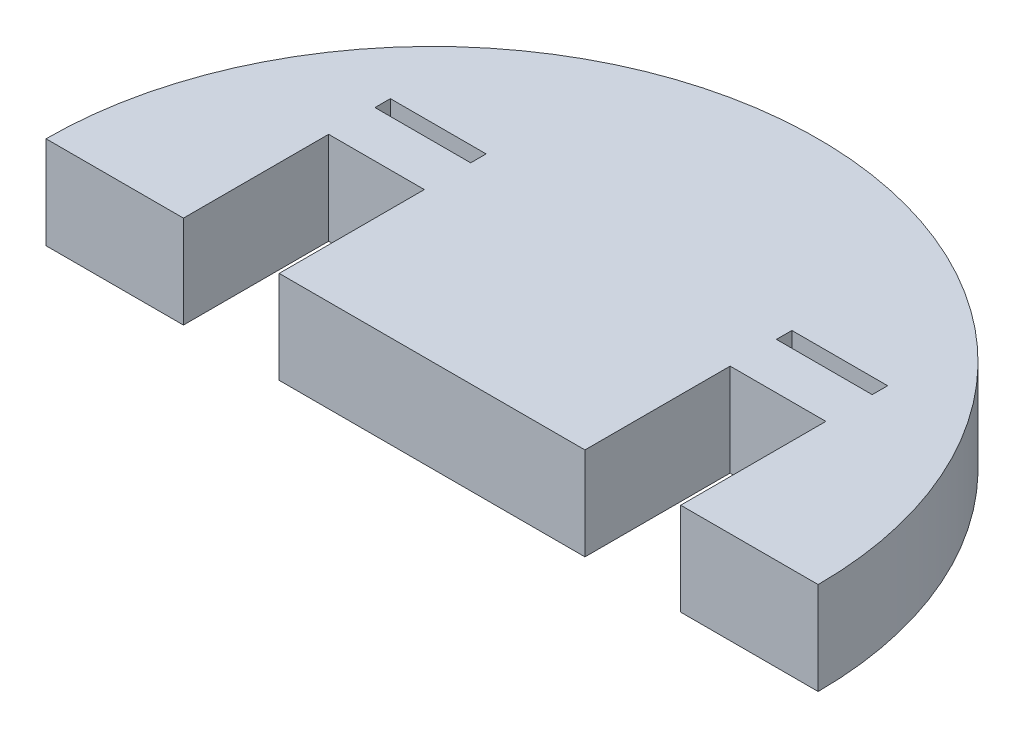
ISO-10303-21;
HEADER;
FILE_DESCRIPTION(('STEP AP214'),'2;1');
FILE_NAME('part.step','',(''),(''),'','','');
FILE_SCHEMA(('AUTOMOTIVE_DESIGN { 1 0 10303 214 1 1 1 1 }'));
ENDSEC;
DATA;
#1=APPLICATION_CONTEXT('core data for automotive mechanical design processes');
#2=APPLICATION_PROTOCOL_DEFINITION('international standard','automotive_design',2000,#1);
#3=PRODUCT_CONTEXT('',#1,'mechanical');
#4=PRODUCT('Part','Part','',(#3));
#5=PRODUCT_RELATED_PRODUCT_CATEGORY('part','',(#4));
#6=PRODUCT_DEFINITION_FORMATION('','',#4);
#7=PRODUCT_DEFINITION_CONTEXT('part definition',#1,'design');
#8=PRODUCT_DEFINITION('design','',#6,#7);
#9=PRODUCT_DEFINITION_SHAPE('','',#8);
#10=(LENGTH_UNIT() NAMED_UNIT(*) SI_UNIT(.MILLI.,.METRE.));
#11=(NAMED_UNIT(*) PLANE_ANGLE_UNIT() SI_UNIT($,.RADIAN.));
#12=(NAMED_UNIT(*) SI_UNIT($,.STERADIAN.) SOLID_ANGLE_UNIT());
#13=UNCERTAINTY_MEASURE_WITH_UNIT(LENGTH_MEASURE(1.E-05),#10,'distance_accuracy_value','');
#14=(GEOMETRIC_REPRESENTATION_CONTEXT(3) GLOBAL_UNCERTAINTY_ASSIGNED_CONTEXT((#13)) GLOBAL_UNIT_ASSIGNED_CONTEXT((#10,
#11,#12)) REPRESENTATION_CONTEXT('',''));
#15=CARTESIAN_POINT('',(0.,0.,0.));
#16=DIRECTION('',(0.,0.,1.));
#17=DIRECTION('',(1.,0.,0.));
#18=AXIS2_PLACEMENT_3D('',#15,#16,#17);
#19=CARTESIAN_POINT('',(16.1,-3.,-13.4));
#20=DIRECTION('',(-1.,0.,0.));
#21=DIRECTION('',(0.,0.,1.));
#22=AXIS2_PLACEMENT_3D('',#19,#20,#21);
#23=PLANE('',#22);
#24=DIRECTION('',(0.,1.,0.));
#25=VECTOR('',#24,1.);
#26=CARTESIAN_POINT('',(16.1,-3.,-13.4));
#27=LINE('',#26,#25);
#28=CARTESIAN_POINT('',(16.1,-3.,-13.4));
#29=VERTEX_POINT('',#28);
#30=CARTESIAN_POINT('',(16.1,3.,-13.4));
#31=VERTEX_POINT('',#30);
#32=EDGE_CURVE('E314',#29,#31,#27,.T.);
#33=ORIENTED_EDGE('',*,*,#32,.F.);
#34=DIRECTION('',(0.,0.,1.));
#35=VECTOR('',#34,1.);
#36=CARTESIAN_POINT('',(16.1,-3.,0.));
#37=LINE('',#36,#35);
#38=CARTESIAN_POINT('',(16.1,-3.,-12.4));
#39=VERTEX_POINT('',#38);
#40=EDGE_CURVE('E244',#29,#39,#37,.T.);
#41=ORIENTED_EDGE('',*,*,#40,.T.);
#42=DIRECTION('',(0.,1.,0.));
#43=VECTOR('',#42,1.);
#44=CARTESIAN_POINT('',(16.1,-3.,-12.4));
#45=LINE('',#44,#43);
#46=CARTESIAN_POINT('',(16.1,3.,-12.4));
#47=VERTEX_POINT('',#46);
#48=EDGE_CURVE('E320',#47,#39,#45,.F.);
#49=ORIENTED_EDGE('',*,*,#48,.F.);
#50=DIRECTION('',(0.,0.,1.));
#51=VECTOR('',#50,1.);
#52=CARTESIAN_POINT('',(16.1,3.,-13.4));
#53=LINE('',#52,#51);
#54=EDGE_CURVE('E251',#47,#31,#53,.F.);
#55=ORIENTED_EDGE('',*,*,#54,.T.);
#56=EDGE_LOOP('',(#33,#41,#49,#55));
#57=FACE_BOUND('',#56,.T.);
#58=ADVANCED_FACE('F17',(#57),#23,.T.);
#59=CARTESIAN_POINT('',(9.9,-3.,-12.4));
#60=DIRECTION('',(1.,0.,0.));
#61=DIRECTION('',(0.,0.,-1.));
#62=AXIS2_PLACEMENT_3D('',#59,#60,#61);
#63=PLANE('',#62);
#64=DIRECTION('',(0.,1.,0.));
#65=VECTOR('',#64,1.);
#66=CARTESIAN_POINT('',(9.9,-3.,-12.4));
#67=LINE('',#66,#65);
#68=CARTESIAN_POINT('',(9.9,-3.,-12.4));
#69=VERTEX_POINT('',#68);
#70=CARTESIAN_POINT('',(9.9,3.,-12.4));
#71=VERTEX_POINT('',#70);
#72=EDGE_CURVE('E254',#69,#71,#67,.T.);
#73=ORIENTED_EDGE('',*,*,#72,.F.);
#74=DIRECTION('',(0.,0.,1.));
#75=VECTOR('',#74,1.);
#76=CARTESIAN_POINT('',(9.9,-3.,0.));
#77=LINE('',#76,#75);
#78=CARTESIAN_POINT('',(9.9,-3.,-13.4));
#79=VERTEX_POINT('',#78);
#80=EDGE_CURVE('E242',#69,#79,#77,.F.);
#81=ORIENTED_EDGE('',*,*,#80,.T.);
#82=DIRECTION('',(0.,1.,0.));
#83=VECTOR('',#82,1.);
#84=CARTESIAN_POINT('',(9.9,-3.,-13.4));
#85=LINE('',#84,#83);
#86=CARTESIAN_POINT('',(9.9,3.,-13.4));
#87=VERTEX_POINT('',#86);
#88=EDGE_CURVE('E311',#87,#79,#85,.F.);
#89=ORIENTED_EDGE('',*,*,#88,.F.);
#90=DIRECTION('',(0.,0.,-1.));
#91=VECTOR('',#90,1.);
#92=CARTESIAN_POINT('',(9.9,3.,-12.4));
#93=LINE('',#92,#91);
#94=EDGE_CURVE('E249',#87,#71,#93,.F.);
#95=ORIENTED_EDGE('',*,*,#94,.T.);
#96=EDGE_LOOP('',(#73,#81,#89,#95));
#97=FACE_BOUND('',#96,.T.);
#98=ADVANCED_FACE('F375',(#97),#63,.T.);
#99=CARTESIAN_POINT('',(-9.9,-3.,-13.4));
#100=DIRECTION('',(-1.,0.,0.));
#101=DIRECTION('',(0.,0.,1.));
#102=AXIS2_PLACEMENT_3D('',#99,#100,#101);
#103=PLANE('',#102);
#104=DIRECTION('',(0.,1.,0.));
#105=VECTOR('',#104,1.);
#106=CARTESIAN_POINT('',(-9.9,-3.,-13.4));
#107=LINE('',#106,#105);
#108=CARTESIAN_POINT('',(-9.9,-3.,-13.4));
#109=VERTEX_POINT('',#108);
#110=CARTESIAN_POINT('',(-9.9,3.,-13.4));
#111=VERTEX_POINT('',#110);
#112=EDGE_CURVE('E297',#109,#111,#107,.T.);
#113=ORIENTED_EDGE('',*,*,#112,.F.);
#114=DIRECTION('',(0.,0.,1.));
#115=VECTOR('',#114,1.);
#116=CARTESIAN_POINT('',(-9.9,-3.,0.));
#117=LINE('',#116,#115);
#118=CARTESIAN_POINT('',(-9.9,-3.,-12.4));
#119=VERTEX_POINT('',#118);
#120=EDGE_CURVE('E240',#109,#119,#117,.T.);
#121=ORIENTED_EDGE('',*,*,#120,.T.);
#122=DIRECTION('',(0.,1.,0.));
#123=VECTOR('',#122,1.);
#124=CARTESIAN_POINT('',(-9.9,-3.,-12.4));
#125=LINE('',#124,#123);
#126=CARTESIAN_POINT('',(-9.9,3.,-12.4));
#127=VERTEX_POINT('',#126);
#128=EDGE_CURVE('E302',#127,#119,#125,.F.);
#129=ORIENTED_EDGE('',*,*,#128,.F.);
#130=DIRECTION('',(0.,0.,1.));
#131=VECTOR('',#130,1.);
#132=CARTESIAN_POINT('',(-9.9,3.,-13.4));
#133=LINE('',#132,#131);
#134=EDGE_CURVE('E35',#127,#111,#133,.F.);
#135=ORIENTED_EDGE('',*,*,#134,.T.);
#136=EDGE_LOOP('',(#113,#121,#129,#135));
#137=FACE_BOUND('',#136,.T.);
#138=ADVANCED_FACE('F398',(#137),#103,.T.);
#139=CARTESIAN_POINT('',(-16.1,-3.,-12.4));
#140=DIRECTION('',(1.,0.,0.));
#141=DIRECTION('',(0.,0.,-1.));
#142=AXIS2_PLACEMENT_3D('',#139,#140,#141);
#143=PLANE('',#142);
#144=DIRECTION('',(0.,1.,0.));
#145=VECTOR('',#144,1.);
#146=CARTESIAN_POINT('',(-16.1,-3.,-12.4));
#147=LINE('',#146,#145);
#148=CARTESIAN_POINT('',(-16.1,-3.,-12.4));
#149=VERTEX_POINT('',#148);
#150=CARTESIAN_POINT('',(-16.1,3.,-12.4));
#151=VERTEX_POINT('',#150);
#152=EDGE_CURVE('E305',#149,#151,#147,.T.);
#153=ORIENTED_EDGE('',*,*,#152,.F.);
#154=DIRECTION('',(0.,0.,1.));
#155=VECTOR('',#154,1.);
#156=CARTESIAN_POINT('',(-16.1,-3.,0.));
#157=LINE('',#156,#155);
#158=CARTESIAN_POINT('',(-16.1,-3.,-13.4));
#159=VERTEX_POINT('',#158);
#160=EDGE_CURVE('E238',#149,#159,#157,.F.);
#161=ORIENTED_EDGE('',*,*,#160,.T.);
#162=DIRECTION('',(0.,1.,0.));
#163=VECTOR('',#162,1.);
#164=CARTESIAN_POINT('',(-16.1,-3.,-13.4));
#165=LINE('',#164,#163);
#166=CARTESIAN_POINT('',(-16.1,3.,-13.4));
#167=VERTEX_POINT('',#166);
#168=EDGE_CURVE('E294',#167,#159,#165,.F.);
#169=ORIENTED_EDGE('',*,*,#168,.F.);
#170=DIRECTION('',(0.,0.,-1.));
#171=VECTOR('',#170,1.);
#172=CARTESIAN_POINT('',(-16.1,3.,-12.4));
#173=LINE('',#172,#171);
#174=EDGE_CURVE('E246',#167,#151,#173,.F.);
#175=ORIENTED_EDGE('',*,*,#174,.T.);
#176=EDGE_LOOP('',(#153,#161,#169,#175));
#177=FACE_BOUND('',#176,.T.);
#178=ADVANCED_FACE('F393',(#177),#143,.T.);
#179=CARTESIAN_POINT('',(0.,-3.,0.));
#180=DIRECTION('',(0.,1.,0.));
#181=DIRECTION('',(0.,0.,1.));
#182=AXIS2_PLACEMENT_3D('',#179,#180,#181);
#183=PLANE('',#182);
#184=ORIENTED_EDGE('',*,*,#160,.F.);
#185=DIRECTION('',(-1.,0.,0.));
#186=VECTOR('',#185,1.);
#187=CARTESIAN_POINT('',(-9.9,-3.,-12.4));
#188=LINE('',#187,#186);
#189=EDGE_CURVE('E299',#119,#149,#188,.T.);
#190=ORIENTED_EDGE('',*,*,#189,.F.);
#191=ORIENTED_EDGE('',*,*,#120,.F.);
#192=DIRECTION('',(1.,0.,0.));
#193=VECTOR('',#192,1.);
#194=CARTESIAN_POINT('',(-16.1,-3.,-13.4));
#195=LINE('',#194,#193);
#196=EDGE_CURVE('E291',#159,#109,#195,.T.);
#197=ORIENTED_EDGE('',*,*,#196,.F.);
#198=EDGE_LOOP('',(#184,#190,#191,#197));
#199=FACE_BOUND('',#198,.T.);
#200=DIRECTION('',(-1.,0.,0.));
#201=VECTOR('',#200,1.);
#202=CARTESIAN_POINT('',(16.1,-3.,-12.4));
#203=LINE('',#202,#201);
#204=EDGE_CURVE('E317',#39,#69,#203,.T.);
#205=ORIENTED_EDGE('',*,*,#204,.F.);
#206=ORIENTED_EDGE('',*,*,#40,.F.);
#207=DIRECTION('',(1.,0.,0.));
#208=VECTOR('',#207,1.);
#209=CARTESIAN_POINT('',(9.9,-3.,-13.4));
#210=LINE('',#209,#208);
#211=EDGE_CURVE('E308',#79,#29,#210,.T.);
#212=ORIENTED_EDGE('',*,*,#211,.F.);
#213=ORIENTED_EDGE('',*,*,#80,.F.);
#214=EDGE_LOOP('',(#205,#206,#212,#213));
#215=FACE_BOUND('',#214,.T.);
#216=DIRECTION('',(1.,0.,0.));
#217=VECTOR('',#216,1.);
#218=CARTESIAN_POINT('',(16.1,-3.,0.));
#219=LINE('',#218,#217);
#220=CARTESIAN_POINT('',(16.1,-3.,0.));
#221=VERTEX_POINT('',#220);
#222=CARTESIAN_POINT('',(25.,-3.,0.));
#223=VERTEX_POINT('',#222);
#224=EDGE_CURVE('E138',#221,#223,#219,.T.);
#225=ORIENTED_EDGE('',*,*,#224,.F.);
#226=DIRECTION('',(0.,0.,1.));
#227=VECTOR('',#226,1.);
#228=CARTESIAN_POINT('',(16.1,-3.,-9.4));
#229=LINE('',#228,#227);
#230=CARTESIAN_POINT('',(16.1,-3.,-9.4));
#231=VERTEX_POINT('',#230);
#232=EDGE_CURVE('E167',#231,#221,#229,.T.);
#233=ORIENTED_EDGE('',*,*,#232,.F.);
#234=DIRECTION('',(1.,0.,0.));
#235=VECTOR('',#234,1.);
#236=CARTESIAN_POINT('',(9.9,-3.,-9.4));
#237=LINE('',#236,#235);
#238=CARTESIAN_POINT('',(9.9,-3.,-9.4));
#239=VERTEX_POINT('',#238);
#240=EDGE_CURVE('E180',#239,#231,#237,.T.);
#241=ORIENTED_EDGE('',*,*,#240,.F.);
#242=DIRECTION('',(0.,0.,-1.));
#243=VECTOR('',#242,1.);
#244=CARTESIAN_POINT('',(9.9,-3.,0.));
#245=LINE('',#244,#243);
#246=CARTESIAN_POINT('',(9.9,-3.,0.));
#247=VERTEX_POINT('',#246);
#248=EDGE_CURVE('E191',#247,#239,#245,.T.);
#249=ORIENTED_EDGE('',*,*,#248,.F.);
#250=DIRECTION('',(1.,0.,0.));
#251=VECTOR('',#250,1.);
#252=CARTESIAN_POINT('',(-9.9,-3.,0.));
#253=LINE('',#252,#251);
#254=CARTESIAN_POINT('',(-9.9,-3.,0.));
#255=VERTEX_POINT('',#254);
#256=EDGE_CURVE('E202',#255,#247,#253,.T.);
#257=ORIENTED_EDGE('',*,*,#256,.F.);
#258=DIRECTION('',(0.,0.,1.));
#259=VECTOR('',#258,1.);
#260=CARTESIAN_POINT('',(-9.9,-3.,-9.4));
#261=LINE('',#260,#259);
#262=CARTESIAN_POINT('',(-9.9,-3.,-9.4));
#263=VERTEX_POINT('',#262);
#264=EDGE_CURVE('E213',#263,#255,#261,.T.);
#265=ORIENTED_EDGE('',*,*,#264,.F.);
#266=DIRECTION('',(1.,0.,0.));
#267=VECTOR('',#266,1.);
#268=CARTESIAN_POINT('',(-16.1,-3.,-9.4));
#269=LINE('',#268,#267);
#270=CARTESIAN_POINT('',(-16.1,-3.,-9.4));
#271=VERTEX_POINT('',#270);
#272=EDGE_CURVE('E224',#271,#263,#269,.T.);
#273=ORIENTED_EDGE('',*,*,#272,.F.);
#274=DIRECTION('',(0.,0.,-1.));
#275=VECTOR('',#274,1.);
#276=CARTESIAN_POINT('',(-16.1,-3.,0.));
#277=LINE('',#276,#275);
#278=CARTESIAN_POINT('',(-16.1,-3.,0.));
#279=VERTEX_POINT('',#278);
#280=EDGE_CURVE('E235',#279,#271,#277,.T.);
#281=ORIENTED_EDGE('',*,*,#280,.F.);
#282=DIRECTION('',(1.,0.,0.));
#283=VECTOR('',#282,1.);
#284=CARTESIAN_POINT('',(-25.,-3.,0.));
#285=LINE('',#284,#283);
#286=CARTESIAN_POINT('',(-25.,-3.,0.));
#287=VERTEX_POINT('',#286);
#288=EDGE_CURVE('E153',#287,#279,#285,.T.);
#289=ORIENTED_EDGE('',*,*,#288,.F.);
#290=CARTESIAN_POINT('',(0.,-3.,0.));
#291=DIRECTION('',(0.,1.,0.));
#292=DIRECTION('',(0.,0.,1.));
#293=AXIS2_PLACEMENT_3D('',#290,#291,#292);
#294=CIRCLE('',#293,25.);
#295=EDGE_CURVE('E20',#223,#287,#294,.T.);
#296=ORIENTED_EDGE('',*,*,#295,.F.);
#297=EDGE_LOOP('',(#225,#233,#241,#249,#257,#265,#273,#281,#289,#296));
#298=FACE_BOUND('',#297,.T.);
#299=ADVANCED_FACE('F151',(#199,#215,#298),#183,.F.);
#300=CARTESIAN_POINT('',(-16.1,-3.,0.));
#301=DIRECTION('',(1.,0.,0.));
#302=DIRECTION('',(0.,0.,-1.));
#303=AXIS2_PLACEMENT_3D('',#300,#301,#302);
#304=PLANE('',#303);
#305=DIRECTION('',(0.,1.,0.));
#306=VECTOR('',#305,1.);
#307=CARTESIAN_POINT('',(-16.1,-3.,0.));
#308=LINE('',#307,#306);
#309=CARTESIAN_POINT('',(-16.1,3.,0.));
#310=VERTEX_POINT('',#309);
#311=EDGE_CURVE('E156',#279,#310,#308,.T.);
#312=ORIENTED_EDGE('',*,*,#311,.F.);
#313=ORIENTED_EDGE('',*,*,#280,.T.);
#314=DIRECTION('',(0.,1.,0.));
#315=VECTOR('',#314,1.);
#316=CARTESIAN_POINT('',(-16.1,-3.,-9.4));
#317=LINE('',#316,#315);
#318=CARTESIAN_POINT('',(-16.1,3.,-9.4));
#319=VERTEX_POINT('',#318);
#320=EDGE_CURVE('E232',#319,#271,#317,.F.);
#321=ORIENTED_EDGE('',*,*,#320,.F.);
#322=DIRECTION('',(0.,0.,1.));
#323=VECTOR('',#322,1.);
#324=CARTESIAN_POINT('',(-16.1,3.,0.));
#325=LINE('',#324,#323);
#326=EDGE_CURVE('E229',#310,#319,#325,.F.);
#327=ORIENTED_EDGE('',*,*,#326,.F.);
#328=EDGE_LOOP('',(#312,#313,#321,#327));
#329=FACE_BOUND('',#328,.T.);
#330=ADVANCED_FACE('F335',(#329),#304,.T.);
#331=CARTESIAN_POINT('',(-16.1,-3.,-9.4));
#332=DIRECTION('',(0.,0.,1.));
#333=DIRECTION('',(1.,0.,0.));
#334=AXIS2_PLACEMENT_3D('',#331,#332,#333);
#335=PLANE('',#334);
#336=ORIENTED_EDGE('',*,*,#320,.T.);
#337=ORIENTED_EDGE('',*,*,#272,.T.);
#338=DIRECTION('',(0.,1.,0.));
#339=VECTOR('',#338,1.);
#340=CARTESIAN_POINT('',(-9.9,-3.,-9.4));
#341=LINE('',#340,#339);
#342=CARTESIAN_POINT('',(-9.9,3.,-9.4));
#343=VERTEX_POINT('',#342);
#344=EDGE_CURVE('E221',#343,#263,#341,.F.);
#345=ORIENTED_EDGE('',*,*,#344,.F.);
#346=DIRECTION('',(1.,0.,0.));
#347=VECTOR('',#346,1.);
#348=CARTESIAN_POINT('',(0.,3.,-9.4));
#349=LINE('',#348,#347);
#350=EDGE_CURVE('E218',#319,#343,#349,.T.);
#351=ORIENTED_EDGE('',*,*,#350,.F.);
#352=EDGE_LOOP('',(#336,#337,#345,#351));
#353=FACE_BOUND('',#352,.T.);
#354=ADVANCED_FACE('F411',(#353),#335,.T.);
#355=CARTESIAN_POINT('',(-9.9,-3.,-9.4));
#356=DIRECTION('',(-1.,0.,0.));
#357=DIRECTION('',(0.,0.,1.));
#358=AXIS2_PLACEMENT_3D('',#355,#356,#357);
#359=PLANE('',#358);
#360=ORIENTED_EDGE('',*,*,#344,.T.);
#361=ORIENTED_EDGE('',*,*,#264,.T.);
#362=DIRECTION('',(0.,1.,0.));
#363=VECTOR('',#362,1.);
#364=CARTESIAN_POINT('',(-9.9,-3.,0.));
#365=LINE('',#364,#363);
#366=CARTESIAN_POINT('',(-9.9,3.,0.));
#367=VERTEX_POINT('',#366);
#368=EDGE_CURVE('E210',#367,#255,#365,.F.);
#369=ORIENTED_EDGE('',*,*,#368,.F.);
#370=DIRECTION('',(0.,0.,1.));
#371=VECTOR('',#370,1.);
#372=CARTESIAN_POINT('',(-9.9,3.,0.));
#373=LINE('',#372,#371);
#374=EDGE_CURVE('E207',#343,#367,#373,.T.);
#375=ORIENTED_EDGE('',*,*,#374,.F.);
#376=EDGE_LOOP('',(#360,#361,#369,#375));
#377=FACE_BOUND('',#376,.T.);
#378=ADVANCED_FACE('F414',(#377),#359,.T.);
#379=CARTESIAN_POINT('',(-9.9,-3.,0.));
#380=DIRECTION('',(0.,0.,1.));
#381=DIRECTION('',(1.,0.,0.));
#382=AXIS2_PLACEMENT_3D('',#379,#380,#381);
#383=PLANE('',#382);
#384=ORIENTED_EDGE('',*,*,#368,.T.);
#385=ORIENTED_EDGE('',*,*,#256,.T.);
#386=DIRECTION('',(0.,1.,0.));
#387=VECTOR('',#386,1.);
#388=CARTESIAN_POINT('',(9.9,-3.,0.));
#389=LINE('',#388,#387);
#390=CARTESIAN_POINT('',(9.9,3.,0.));
#391=VERTEX_POINT('',#390);
#392=EDGE_CURVE('E199',#391,#247,#389,.F.);
#393=ORIENTED_EDGE('',*,*,#392,.F.);
#394=DIRECTION('',(1.,0.,0.));
#395=VECTOR('',#394,1.);
#396=CARTESIAN_POINT('',(0.,3.,0.));
#397=LINE('',#396,#395);
#398=EDGE_CURVE('E196',#367,#391,#397,.T.);
#399=ORIENTED_EDGE('',*,*,#398,.F.);
#400=EDGE_LOOP('',(#384,#385,#393,#399));
#401=FACE_BOUND('',#400,.T.);
#402=ADVANCED_FACE('F418',(#401),#383,.T.);
#403=CARTESIAN_POINT('',(9.9,-3.,0.));
#404=DIRECTION('',(1.,0.,0.));
#405=DIRECTION('',(0.,0.,-1.));
#406=AXIS2_PLACEMENT_3D('',#403,#404,#405);
#407=PLANE('',#406);
#408=ORIENTED_EDGE('',*,*,#392,.T.);
#409=ORIENTED_EDGE('',*,*,#248,.T.);
#410=DIRECTION('',(0.,1.,0.));
#411=VECTOR('',#410,1.);
#412=CARTESIAN_POINT('',(9.9,-3.,-9.4));
#413=LINE('',#412,#411);
#414=CARTESIAN_POINT('',(9.9,3.,-9.4));
#415=VERTEX_POINT('',#414);
#416=EDGE_CURVE('E188',#415,#239,#413,.F.);
#417=ORIENTED_EDGE('',*,*,#416,.F.);
#418=DIRECTION('',(0.,0.,1.));
#419=VECTOR('',#418,1.);
#420=CARTESIAN_POINT('',(9.9,3.,0.));
#421=LINE('',#420,#419);
#422=EDGE_CURVE('E185',#391,#415,#421,.F.);
#423=ORIENTED_EDGE('',*,*,#422,.F.);
#424=EDGE_LOOP('',(#408,#409,#417,#423));
#425=FACE_BOUND('',#424,.T.);
#426=ADVANCED_FACE('F422',(#425),#407,.T.);
#427=CARTESIAN_POINT('',(9.9,-3.,-9.4));
#428=DIRECTION('',(0.,0.,1.));
#429=DIRECTION('',(1.,0.,0.));
#430=AXIS2_PLACEMENT_3D('',#427,#428,#429);
#431=PLANE('',#430);
#432=ORIENTED_EDGE('',*,*,#416,.T.);
#433=ORIENTED_EDGE('',*,*,#240,.T.);
#434=DIRECTION('',(0.,1.,0.));
#435=VECTOR('',#434,1.);
#436=CARTESIAN_POINT('',(16.1,-3.,-9.4));
#437=LINE('',#436,#435);
#438=CARTESIAN_POINT('',(16.1,3.,-9.4));
#439=VERTEX_POINT('',#438);
#440=EDGE_CURVE('E177',#439,#231,#437,.F.);
#441=ORIENTED_EDGE('',*,*,#440,.F.);
#442=DIRECTION('',(1.,0.,0.));
#443=VECTOR('',#442,1.);
#444=CARTESIAN_POINT('',(0.,3.,-9.4));
#445=LINE('',#444,#443);
#446=EDGE_CURVE('E174',#415,#439,#445,.T.);
#447=ORIENTED_EDGE('',*,*,#446,.F.);
#448=EDGE_LOOP('',(#432,#433,#441,#447));
#449=FACE_BOUND('',#448,.T.);
#450=ADVANCED_FACE('F426',(#449),#431,.T.);
#451=CARTESIAN_POINT('',(16.1,-3.,-9.4));
#452=DIRECTION('',(-1.,0.,0.));
#453=DIRECTION('',(0.,0.,1.));
#454=AXIS2_PLACEMENT_3D('',#451,#452,#453);
#455=PLANE('',#454);
#456=ORIENTED_EDGE('',*,*,#440,.T.);
#457=ORIENTED_EDGE('',*,*,#232,.T.);
#458=DIRECTION('',(0.,1.,0.));
#459=VECTOR('',#458,1.);
#460=CARTESIAN_POINT('',(16.1,-3.,0.));
#461=LINE('',#460,#459);
#462=CARTESIAN_POINT('',(16.1,3.,0.));
#463=VERTEX_POINT('',#462);
#464=EDGE_CURVE('E145',#463,#221,#461,.F.);
#465=ORIENTED_EDGE('',*,*,#464,.F.);
#466=DIRECTION('',(0.,0.,1.));
#467=VECTOR('',#466,1.);
#468=CARTESIAN_POINT('',(16.1,3.,0.));
#469=LINE('',#468,#467);
#470=EDGE_CURVE('E170',#439,#463,#469,.T.);
#471=ORIENTED_EDGE('',*,*,#470,.F.);
#472=EDGE_LOOP('',(#456,#457,#465,#471));
#473=FACE_BOUND('',#472,.T.);
#474=ADVANCED_FACE('F430',(#473),#455,.T.);
#475=CARTESIAN_POINT('',(16.1,-3.,0.));
#476=DIRECTION('',(0.,0.,1.));
#477=DIRECTION('',(1.,0.,0.));
#478=AXIS2_PLACEMENT_3D('',#475,#476,#477);
#479=PLANE('',#478);
#480=ORIENTED_EDGE('',*,*,#464,.T.);
#481=ORIENTED_EDGE('',*,*,#224,.T.);
#482=DIRECTION('',(0.,1.,0.));
#483=VECTOR('',#482,1.);
#484=CARTESIAN_POINT('',(25.,-3.,0.));
#485=LINE('',#484,#483);
#486=CARTESIAN_POINT('',(25.,3.,0.));
#487=VERTEX_POINT('',#486);
#488=EDGE_CURVE('E143',#487,#223,#485,.F.);
#489=ORIENTED_EDGE('',*,*,#488,.F.);
#490=DIRECTION('',(1.,0.,0.));
#491=VECTOR('',#490,1.);
#492=CARTESIAN_POINT('',(0.,3.,0.));
#493=LINE('',#492,#491);
#494=EDGE_CURVE('E173',#463,#487,#493,.T.);
#495=ORIENTED_EDGE('',*,*,#494,.F.);
#496=EDGE_LOOP('',(#480,#481,#489,#495));
#497=FACE_BOUND('',#496,.T.);
#498=ADVANCED_FACE('F140',(#497),#479,.T.);
#499=CARTESIAN_POINT('',(0.,-3.,0.));
#500=DIRECTION('',(0.,1.,0.));
#501=DIRECTION('',(0.,0.,1.));
#502=AXIS2_PLACEMENT_3D('',#499,#500,#501);
#503=CYLINDRICAL_SURFACE('',#502,25.);
#504=ORIENTED_EDGE('',*,*,#488,.T.);
#505=ORIENTED_EDGE('',*,*,#295,.T.);
#506=DIRECTION('',(0.,1.,0.));
#507=VECTOR('',#506,1.);
#508=CARTESIAN_POINT('',(-25.,-3.,0.));
#509=LINE('',#508,#507);
#510=CARTESIAN_POINT('',(-25.,3.,0.));
#511=VERTEX_POINT('',#510);
#512=EDGE_CURVE('E255',#511,#287,#509,.F.);
#513=ORIENTED_EDGE('',*,*,#512,.F.);
#514=CARTESIAN_POINT('',(0.,3.,0.));
#515=DIRECTION('',(0.,1.,0.));
#516=DIRECTION('',(0.,0.,1.));
#517=AXIS2_PLACEMENT_3D('',#514,#515,#516);
#518=CIRCLE('',#517,25.);
#519=EDGE_CURVE('E159',#487,#511,#518,.T.);
#520=ORIENTED_EDGE('',*,*,#519,.F.);
#521=EDGE_LOOP('',(#504,#505,#513,#520));
#522=FACE_BOUND('',#521,.T.);
#523=ADVANCED_FACE('F157',(#522),#503,.T.);
#524=CARTESIAN_POINT('',(-25.,-3.,0.));
#525=DIRECTION('',(0.,0.,1.));
#526=DIRECTION('',(1.,0.,0.));
#527=AXIS2_PLACEMENT_3D('',#524,#525,#526);
#528=PLANE('',#527);
#529=ORIENTED_EDGE('',*,*,#512,.T.);
#530=ORIENTED_EDGE('',*,*,#288,.T.);
#531=ORIENTED_EDGE('',*,*,#311,.T.);
#532=DIRECTION('',(1.,0.,0.));
#533=VECTOR('',#532,1.);
#534=CARTESIAN_POINT('',(0.,3.,0.));
#535=LINE('',#534,#533);
#536=EDGE_CURVE('E280',#511,#310,#535,.T.);
#537=ORIENTED_EDGE('',*,*,#536,.F.);
#538=EDGE_LOOP('',(#529,#530,#531,#537));
#539=FACE_BOUND('',#538,.T.);
#540=ADVANCED_FACE('F337',(#539),#528,.T.);
#541=CARTESIAN_POINT('',(16.1,-3.,-12.4));
#542=DIRECTION('',(0.,0.,-1.));
#543=DIRECTION('',(-1.,0.,0.));
#544=AXIS2_PLACEMENT_3D('',#541,#542,#543);
#545=PLANE('',#544);
#546=ORIENTED_EDGE('',*,*,#48,.T.);
#547=ORIENTED_EDGE('',*,*,#204,.T.);
#548=ORIENTED_EDGE('',*,*,#72,.T.);
#549=DIRECTION('',(1.,0.,0.));
#550=VECTOR('',#549,1.);
#551=CARTESIAN_POINT('',(0.,3.,-12.4));
#552=LINE('',#551,#550);
#553=EDGE_CURVE('E283',#47,#71,#552,.F.);
#554=ORIENTED_EDGE('',*,*,#553,.F.);
#555=EDGE_LOOP('',(#546,#547,#548,#554));
#556=FACE_BOUND('',#555,.T.);
#557=ADVANCED_FACE('F339',(#556),#545,.T.);
#558=CARTESIAN_POINT('',(9.9,-3.,-13.4));
#559=DIRECTION('',(0.,0.,1.));
#560=DIRECTION('',(1.,0.,0.));
#561=AXIS2_PLACEMENT_3D('',#558,#559,#560);
#562=PLANE('',#561);
#563=ORIENTED_EDGE('',*,*,#88,.T.);
#564=ORIENTED_EDGE('',*,*,#211,.T.);
#565=ORIENTED_EDGE('',*,*,#32,.T.);
#566=DIRECTION('',(1.,0.,0.));
#567=VECTOR('',#566,1.);
#568=CARTESIAN_POINT('',(0.,3.,-13.4));
#569=LINE('',#568,#567);
#570=EDGE_CURVE('E373',#87,#31,#569,.T.);
#571=ORIENTED_EDGE('',*,*,#570,.F.);
#572=EDGE_LOOP('',(#563,#564,#565,#571));
#573=FACE_BOUND('',#572,.T.);
#574=ADVANCED_FACE('F346',(#573),#562,.T.);
#575=CARTESIAN_POINT('',(-9.9,-3.,-12.4));
#576=DIRECTION('',(0.,0.,-1.));
#577=DIRECTION('',(-1.,0.,0.));
#578=AXIS2_PLACEMENT_3D('',#575,#576,#577);
#579=PLANE('',#578);
#580=ORIENTED_EDGE('',*,*,#128,.T.);
#581=ORIENTED_EDGE('',*,*,#189,.T.);
#582=ORIENTED_EDGE('',*,*,#152,.T.);
#583=DIRECTION('',(1.,0.,0.));
#584=VECTOR('',#583,1.);
#585=CARTESIAN_POINT('',(0.,3.,-12.4));
#586=LINE('',#585,#584);
#587=EDGE_CURVE('E26',#127,#151,#586,.F.);
#588=ORIENTED_EDGE('',*,*,#587,.F.);
#589=EDGE_LOOP('',(#580,#581,#582,#588));
#590=FACE_BOUND('',#589,.T.);
#591=ADVANCED_FACE('F357',(#590),#579,.T.);
#592=CARTESIAN_POINT('',(-16.1,-3.,-13.4));
#593=DIRECTION('',(0.,0.,1.));
#594=DIRECTION('',(1.,0.,0.));
#595=AXIS2_PLACEMENT_3D('',#592,#593,#594);
#596=PLANE('',#595);
#597=ORIENTED_EDGE('',*,*,#168,.T.);
#598=ORIENTED_EDGE('',*,*,#196,.T.);
#599=ORIENTED_EDGE('',*,*,#112,.T.);
#600=DIRECTION('',(1.,0.,0.));
#601=VECTOR('',#600,1.);
#602=CARTESIAN_POINT('',(0.,3.,-13.4));
#603=LINE('',#602,#601);
#604=EDGE_CURVE('E11',#167,#111,#603,.T.);
#605=ORIENTED_EDGE('',*,*,#604,.F.);
#606=EDGE_LOOP('',(#597,#598,#599,#605));
#607=FACE_BOUND('',#606,.T.);
#608=ADVANCED_FACE('F351',(#607),#596,.T.);
#609=CARTESIAN_POINT('',(0.,3.,0.));
#610=DIRECTION('',(0.,1.,0.));
#611=DIRECTION('',(0.,0.,1.));
#612=AXIS2_PLACEMENT_3D('',#609,#610,#611);
#613=PLANE('',#612);
#614=ORIENTED_EDGE('',*,*,#604,.T.);
#615=ORIENTED_EDGE('',*,*,#134,.F.);
#616=ORIENTED_EDGE('',*,*,#587,.T.);
#617=ORIENTED_EDGE('',*,*,#174,.F.);
#618=EDGE_LOOP('',(#614,#615,#616,#617));
#619=FACE_BOUND('',#618,.T.);
#620=ORIENTED_EDGE('',*,*,#94,.F.);
#621=ORIENTED_EDGE('',*,*,#570,.T.);
#622=ORIENTED_EDGE('',*,*,#54,.F.);
#623=ORIENTED_EDGE('',*,*,#553,.T.);
#624=EDGE_LOOP('',(#620,#621,#622,#623));
#625=FACE_BOUND('',#624,.T.);
#626=ORIENTED_EDGE('',*,*,#519,.T.);
#627=ORIENTED_EDGE('',*,*,#536,.T.);
#628=ORIENTED_EDGE('',*,*,#326,.T.);
#629=ORIENTED_EDGE('',*,*,#350,.T.);
#630=ORIENTED_EDGE('',*,*,#374,.T.);
#631=ORIENTED_EDGE('',*,*,#398,.T.);
#632=ORIENTED_EDGE('',*,*,#422,.T.);
#633=ORIENTED_EDGE('',*,*,#446,.T.);
#634=ORIENTED_EDGE('',*,*,#470,.T.);
#635=ORIENTED_EDGE('',*,*,#494,.T.);
#636=EDGE_LOOP('',(#626,#627,#628,#629,#630,#631,#632,#633,#634,#635));
#637=FACE_BOUND('',#636,.T.);
#638=ADVANCED_FACE('F330',(#619,#625,#637),#613,.T.);
#639=CLOSED_SHELL('',(#58,#98,#138,#178,#299,#330,#354,#378,#402,#426,#450,#474,#498,#523,#540,
#557,#574,#591,#608,#638));
#640=MANIFOLD_SOLID_BREP('B1',#639);
#641=ADVANCED_BREP_SHAPE_REPRESENTATION('',(#18,#640),#14);
#642=SHAPE_DEFINITION_REPRESENTATION(#9,#641);
ENDSEC;
END-ISO-10303-21;
